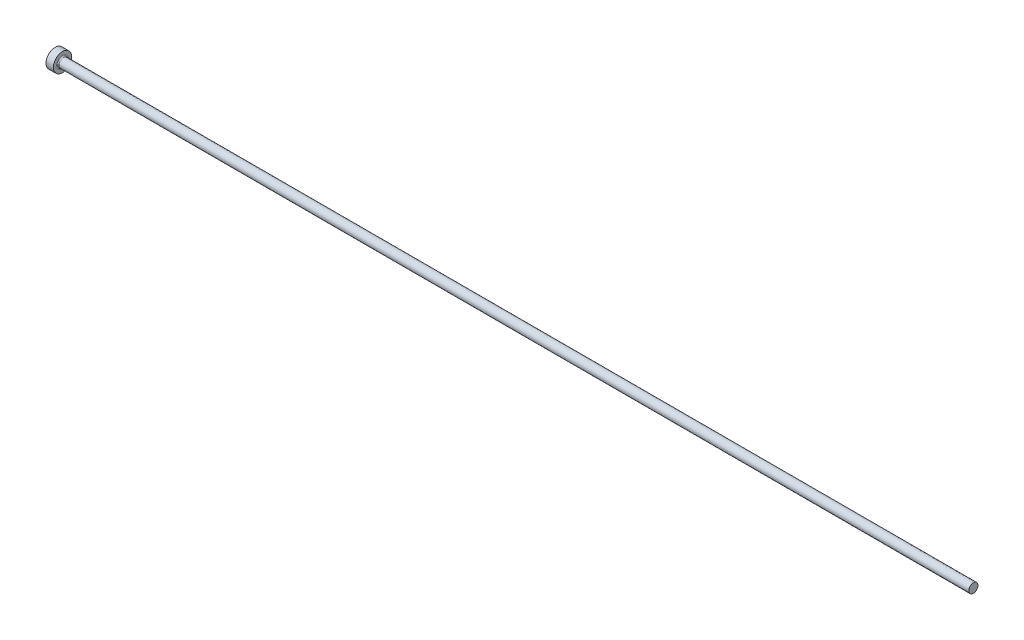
ISO-10303-21;
HEADER;
FILE_DESCRIPTION(('STEP AP214'),'2;1');
FILE_NAME('part.step','',(''),(''),'','','');
FILE_SCHEMA(('AUTOMOTIVE_DESIGN { 1 0 10303 214 1 1 1 1 }'));
ENDSEC;
DATA;
#1=APPLICATION_CONTEXT('core data for automotive mechanical design processes');
#2=APPLICATION_PROTOCOL_DEFINITION('international standard','automotive_design',2000,#1);
#3=PRODUCT_CONTEXT('',#1,'mechanical');
#4=PRODUCT('Part','Part','',(#3));
#5=PRODUCT_RELATED_PRODUCT_CATEGORY('part','',(#4));
#6=PRODUCT_DEFINITION_FORMATION('','',#4);
#7=PRODUCT_DEFINITION_CONTEXT('part definition',#1,'design');
#8=PRODUCT_DEFINITION('design','',#6,#7);
#9=PRODUCT_DEFINITION_SHAPE('','',#8);
#10=(LENGTH_UNIT() NAMED_UNIT(*) SI_UNIT(.MILLI.,.METRE.));
#11=(NAMED_UNIT(*) PLANE_ANGLE_UNIT() SI_UNIT($,.RADIAN.));
#12=(NAMED_UNIT(*) SI_UNIT($,.STERADIAN.) SOLID_ANGLE_UNIT());
#13=UNCERTAINTY_MEASURE_WITH_UNIT(LENGTH_MEASURE(1.E-05),#10,'distance_accuracy_value','');
#14=(GEOMETRIC_REPRESENTATION_CONTEXT(3) GLOBAL_UNCERTAINTY_ASSIGNED_CONTEXT((#13)) GLOBAL_UNIT_ASSIGNED_CONTEXT((#10,
#11,#12)) REPRESENTATION_CONTEXT('',''));
#15=CARTESIAN_POINT('',(0.,0.,0.));
#16=DIRECTION('',(0.,0.,1.));
#17=DIRECTION('',(1.,0.,0.));
#18=AXIS2_PLACEMENT_3D('',#15,#16,#17);
#19=CARTESIAN_POINT('',(0.,0.,0.));
#20=DIRECTION('',(-1.,0.,0.));
#21=DIRECTION('',(0.,-1.,0.));
#22=AXIS2_PLACEMENT_3D('',#19,#20,#21);
#23=PLANE('',#22);
#24=CARTESIAN_POINT('',(0.,0.,0.));
#25=DIRECTION('',(1.,0.,0.));
#26=DIRECTION('',(0.,1.,0.));
#27=AXIS2_PLACEMENT_3D('',#24,#25,#26);
#28=CIRCLE('',#27,2.5);
#29=CARTESIAN_POINT('',(0.,2.5,0.));
#30=VERTEX_POINT('',#29);
#31=EDGE_CURVE('E25',#30,#30,#28,.T.);
#32=ORIENTED_EDGE('',*,*,#31,.F.);
#33=EDGE_LOOP('',(#32));
#34=FACE_BOUND('',#33,.T.);
#35=ADVANCED_FACE('F14',(#34),#23,.T.);
#36=CARTESIAN_POINT('',(250.,0.,0.));
#37=DIRECTION('',(1.,0.,0.));
#38=DIRECTION('',(0.,1.,0.));
#39=AXIS2_PLACEMENT_3D('',#36,#37,#38);
#40=CYLINDRICAL_SURFACE('',#39,2.5);
#41=ORIENTED_EDGE('',*,*,#31,.T.);
#42=EDGE_LOOP('',(#41));
#43=FACE_BOUND('',#42,.T.);
#44=CARTESIAN_POINT('',(2.,0.,0.));
#45=DIRECTION('',(1.,0.,0.));
#46=DIRECTION('',(0.,1.,0.));
#47=AXIS2_PLACEMENT_3D('',#44,#45,#46);
#48=CIRCLE('',#47,2.5);
#49=CARTESIAN_POINT('',(2.,2.5,0.));
#50=VERTEX_POINT('',#49);
#51=EDGE_CURVE('E29',#50,#50,#48,.T.);
#52=ORIENTED_EDGE('',*,*,#51,.F.);
#53=EDGE_LOOP('',(#52));
#54=FACE_BOUND('',#53,.T.);
#55=ADVANCED_FACE('F51',(#43,#54),#40,.T.);
#56=CARTESIAN_POINT('',(2.,2.5,0.));
#57=DIRECTION('',(1.,0.,0.));
#58=DIRECTION('',(0.,1.,0.));
#59=AXIS2_PLACEMENT_3D('',#56,#57,#58);
#60=PLANE('',#59);
#61=CARTESIAN_POINT('',(2.,0.,0.));
#62=DIRECTION('',(1.,0.,0.));
#63=DIRECTION('',(0.,1.,0.));
#64=AXIS2_PLACEMENT_3D('',#61,#62,#63);
#65=CIRCLE('',#64,1.54999999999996);
#66=CARTESIAN_POINT('',(2.,1.54999999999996,0.));
#67=VERTEX_POINT('',#66);
#68=EDGE_CURVE('E9',#67,#67,#65,.F.);
#69=ORIENTED_EDGE('',*,*,#68,.T.);
#70=EDGE_LOOP('',(#69));
#71=FACE_BOUND('',#70,.T.);
#72=ORIENTED_EDGE('',*,*,#51,.T.);
#73=EDGE_LOOP('',(#72));
#74=FACE_BOUND('',#73,.T.);
#75=ADVANCED_FACE('F42',(#71,#74),#60,.T.);
#76=CARTESIAN_POINT('',(250.,0.,0.));
#77=DIRECTION('',(1.,0.,0.));
#78=DIRECTION('',(0.,1.,0.));
#79=AXIS2_PLACEMENT_3D('',#76,#77,#78);
#80=CYLINDRICAL_SURFACE('',#79,1.24999999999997);
#81=CARTESIAN_POINT('',(2.3,0.,0.));
#82=DIRECTION('',(1.,0.,0.));
#83=DIRECTION('',(0.,1.,0.));
#84=AXIS2_PLACEMENT_3D('',#81,#82,#83);
#85=CIRCLE('',#84,1.24999999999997);
#86=CARTESIAN_POINT('',(2.3,1.24999999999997,0.));
#87=VERTEX_POINT('',#86);
#88=EDGE_CURVE('E21',#87,#87,#85,.T.);
#89=ORIENTED_EDGE('',*,*,#88,.T.);
#90=EDGE_LOOP('',(#89));
#91=FACE_BOUND('',#90,.T.);
#92=CARTESIAN_POINT('',(250.,0.,0.));
#93=DIRECTION('',(1.,0.,0.));
#94=DIRECTION('',(0.,1.,0.));
#95=AXIS2_PLACEMENT_3D('',#92,#93,#94);
#96=CIRCLE('',#95,1.24999999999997);
#97=CARTESIAN_POINT('',(250.,1.24999999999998,0.));
#98=VERTEX_POINT('',#97);
#99=EDGE_CURVE('E34',#98,#98,#96,.T.);
#100=ORIENTED_EDGE('',*,*,#99,.F.);
#101=EDGE_LOOP('',(#100));
#102=FACE_BOUND('',#101,.T.);
#103=ADVANCED_FACE('F40',(#91,#102),#80,.T.);
#104=CARTESIAN_POINT('',(250.,1.24999999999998,0.));
#105=DIRECTION('',(1.,0.,0.));
#106=DIRECTION('',(0.,1.,0.));
#107=AXIS2_PLACEMENT_3D('',#104,#105,#106);
#108=PLANE('',#107);
#109=ORIENTED_EDGE('',*,*,#99,.T.);
#110=EDGE_LOOP('',(#109));
#111=FACE_BOUND('',#110,.T.);
#112=ADVANCED_FACE('F38',(#111),#108,.T.);
#113=CARTESIAN_POINT('',(2.3,0.,0.));
#114=DIRECTION('',(1.,0.,0.));
#115=DIRECTION('',(0.,1.,0.));
#116=AXIS2_PLACEMENT_3D('',#113,#114,#115);
#117=TOROIDAL_SURFACE('',#116,1.54999999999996,0.3);
#118=ORIENTED_EDGE('',*,*,#68,.F.);
#119=EDGE_LOOP('',(#118));
#120=FACE_BOUND('',#119,.T.);
#121=ORIENTED_EDGE('',*,*,#88,.F.);
#122=EDGE_LOOP('',(#121));
#123=FACE_BOUND('',#122,.T.);
#124=ADVANCED_FACE('F16',(#120,#123),#117,.F.);
#125=CLOSED_SHELL('',(#35,#55,#75,#103,#112,#124));
#126=MANIFOLD_SOLID_BREP('B1',#125);
#127=ADVANCED_BREP_SHAPE_REPRESENTATION('',(#18,#126),#14);
#128=SHAPE_DEFINITION_REPRESENTATION(#9,#127);
ENDSEC;
END-ISO-10303-21;
